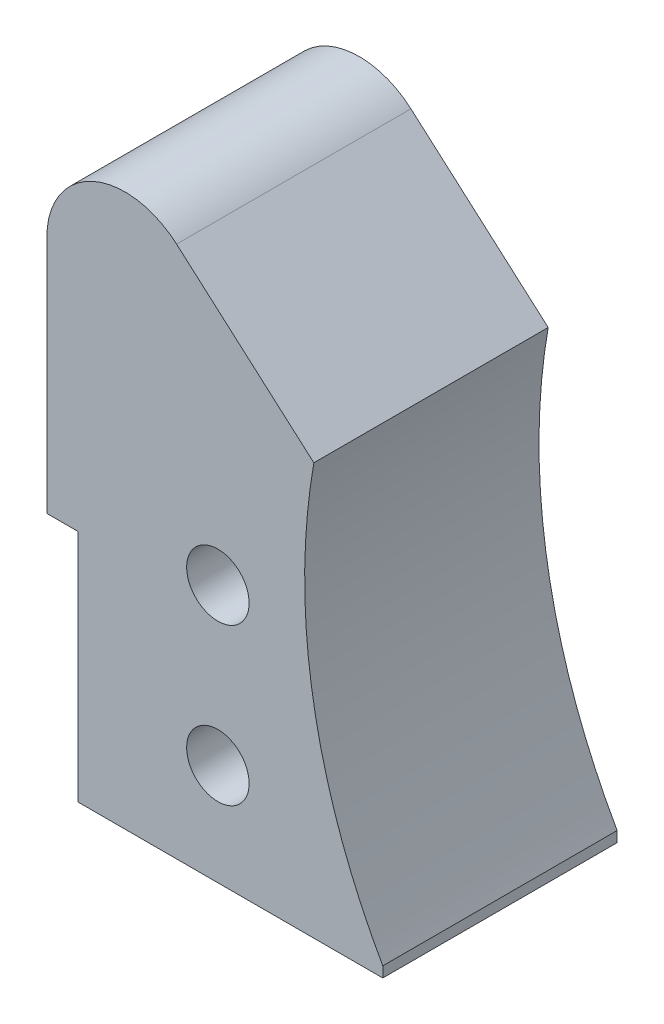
ISO-10303-21;
HEADER;
FILE_DESCRIPTION(('STEP AP214'),'2;1');
FILE_NAME('part.step','',(''),(''),'','','');
FILE_SCHEMA(('AUTOMOTIVE_DESIGN { 1 0 10303 214 1 1 1 1 }'));
ENDSEC;
DATA;
#1=APPLICATION_CONTEXT('core data for automotive mechanical design processes');
#2=APPLICATION_PROTOCOL_DEFINITION('international standard','automotive_design',2000,#1);
#3=PRODUCT_CONTEXT('',#1,'mechanical');
#4=PRODUCT('Part','Part','',(#3));
#5=PRODUCT_RELATED_PRODUCT_CATEGORY('part','',(#4));
#6=PRODUCT_DEFINITION_FORMATION('','',#4);
#7=PRODUCT_DEFINITION_CONTEXT('part definition',#1,'design');
#8=PRODUCT_DEFINITION('design','',#6,#7);
#9=PRODUCT_DEFINITION_SHAPE('','',#8);
#10=(LENGTH_UNIT() NAMED_UNIT(*) SI_UNIT(.MILLI.,.METRE.));
#11=(NAMED_UNIT(*) PLANE_ANGLE_UNIT() SI_UNIT($,.RADIAN.));
#12=(NAMED_UNIT(*) SI_UNIT($,.STERADIAN.) SOLID_ANGLE_UNIT());
#13=UNCERTAINTY_MEASURE_WITH_UNIT(LENGTH_MEASURE(1.E-05),#10,'distance_accuracy_value','');
#14=(GEOMETRIC_REPRESENTATION_CONTEXT(3) GLOBAL_UNCERTAINTY_ASSIGNED_CONTEXT((#13)) GLOBAL_UNIT_ASSIGNED_CONTEXT((#10,
#11,#12)) REPRESENTATION_CONTEXT('',''));
#15=CARTESIAN_POINT('',(0.,0.,0.));
#16=DIRECTION('',(0.,0.,1.));
#17=DIRECTION('',(1.,0.,0.));
#18=AXIS2_PLACEMENT_3D('',#15,#16,#17);
#19=CARTESIAN_POINT('',(-50.,10.6794442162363,8.));
#20=DIRECTION('',(0.,0.,1.));
#21=DIRECTION('',(1.,0.,0.));
#22=AXIS2_PLACEMENT_3D('',#19,#20,#21);
#23=CYLINDRICAL_SURFACE('',#22,5.);
#24=CARTESIAN_POINT('',(-50.,10.6794442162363,-78.));
#25=DIRECTION('',(0.,0.,1.));
#26=DIRECTION('',(-1.,0.,0.));
#27=AXIS2_PLACEMENT_3D('',#24,#25,#26);
#28=CIRCLE('',#27,5.);
#29=CARTESIAN_POINT('',(-46.6980552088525,14.4340627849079,-78.));
#30=VERTEX_POINT('',#29);
#31=CARTESIAN_POINT('',(-55.,10.6794442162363,-78.));
#32=VERTEX_POINT('',#31);
#33=EDGE_CURVE('E21',#30,#32,#28,.T.);
#34=ORIENTED_EDGE('',*,*,#33,.F.);
#35=DIRECTION('',(0.,0.,1.));
#36=VECTOR('',#35,1.);
#37=CARTESIAN_POINT('',(-46.6980552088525,14.4340627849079,-78.));
#38=LINE('',#37,#36);
#39=CARTESIAN_POINT('',(-46.6980552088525,14.4340627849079,-93.));
#40=VERTEX_POINT('',#39);
#41=EDGE_CURVE('E11',#40,#30,#38,.T.);
#42=ORIENTED_EDGE('',*,*,#41,.F.);
#43=CARTESIAN_POINT('',(-50.,10.6794442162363,-93.));
#44=DIRECTION('',(0.,0.,-1.));
#45=DIRECTION('',(-1.,0.,0.));
#46=AXIS2_PLACEMENT_3D('',#43,#44,#45);
#47=CIRCLE('',#46,5.);
#48=CARTESIAN_POINT('',(-55.,10.6794442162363,-93.));
#49=VERTEX_POINT('',#48);
#50=EDGE_CURVE('E121',#49,#40,#47,.T.);
#51=ORIENTED_EDGE('',*,*,#50,.F.);
#52=DIRECTION('',(0.,0.,-1.));
#53=VECTOR('',#52,1.);
#54=CARTESIAN_POINT('',(-55.,10.6794442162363,-93.));
#55=LINE('',#54,#53);
#56=EDGE_CURVE('E109',#32,#49,#55,.T.);
#57=ORIENTED_EDGE('',*,*,#56,.F.);
#58=EDGE_LOOP('',(#34,#42,#51,#57));
#59=FACE_BOUND('',#58,.T.);
#60=ADVANCED_FACE('F17',(#59),#23,.T.);
#61=CARTESIAN_POINT('',(-13.2077791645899,-15.0184742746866,-78.));
#62=DIRECTION('',(0.660388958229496,0.750923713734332,0.));
#63=DIRECTION('',(0.,0.,-1.));
#64=AXIS2_PLACEMENT_3D('',#61,#62,#63);
#65=PLANE('',#64);
#66=DIRECTION('',(0.750923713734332,-0.660388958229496,0.));
#67=VECTOR('',#66,1.);
#68=CARTESIAN_POINT('',(-13.2077791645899,-15.0184742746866,-93.));
#69=LINE('',#68,#67);
#70=CARTESIAN_POINT('',(-37.9113433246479,6.7067165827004,-93.));
#71=VERTEX_POINT('',#70);
#72=EDGE_CURVE('E124',#40,#71,#69,.T.);
#73=ORIENTED_EDGE('',*,*,#72,.F.);
#74=ORIENTED_EDGE('',*,*,#41,.T.);
#75=DIRECTION('',(0.750923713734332,-0.660388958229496,0.));
#76=VECTOR('',#75,1.);
#77=CARTESIAN_POINT('',(-13.2077791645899,-15.0184742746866,-78.));
#78=LINE('',#77,#76);
#79=CARTESIAN_POINT('',(-37.9113433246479,6.7067165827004,-78.));
#80=VERTEX_POINT('',#79);
#81=EDGE_CURVE('E183',#30,#80,#78,.T.);
#82=ORIENTED_EDGE('',*,*,#81,.T.);
#83=DIRECTION('',(0.,0.,-1.));
#84=VECTOR('',#83,1.);
#85=CARTESIAN_POINT('',(-37.9113433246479,6.7067165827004,-78.));
#86=LINE('',#85,#84);
#87=EDGE_CURVE('E132',#80,#71,#86,.T.);
#88=ORIENTED_EDGE('',*,*,#87,.T.);
#89=EDGE_LOOP('',(#73,#74,#82,#88));
#90=FACE_BOUND('',#89,.T.);
#91=ADVANCED_FACE('F19',(#90),#65,.T.);
#92=CARTESIAN_POINT('',(-50.,5.35267143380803,-78.));
#93=DIRECTION('',(0.,0.,-1.));
#94=DIRECTION('',(0.,-1.,0.));
#95=AXIS2_PLACEMENT_3D('',#92,#93,#94);
#96=PLANE('',#95);
#97=CARTESIAN_POINT('',(-44.0547008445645,-3.14732856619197,-78.));
#98=DIRECTION('',(0.,0.,-1.));
#99=DIRECTION('',(-1.,0.,0.));
#100=AXIS2_PLACEMENT_3D('',#97,#98,#99);
#101=CIRCLE('',#100,2.);
#102=CARTESIAN_POINT('',(-46.0547008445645,-3.14732856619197,-78.));
#103=VERTEX_POINT('',#102);
#104=EDGE_CURVE('E208',#103,#103,#101,.T.);
#105=ORIENTED_EDGE('',*,*,#104,.T.);
#106=EDGE_LOOP('',(#105));
#107=FACE_BOUND('',#106,.T.);
#108=CARTESIAN_POINT('',(-44.0547008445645,-13.147328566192,-78.));
#109=DIRECTION('',(0.,0.,-1.));
#110=DIRECTION('',(-1.,0.,0.));
#111=AXIS2_PLACEMENT_3D('',#108,#109,#110);
#112=CIRCLE('',#111,2.);
#113=CARTESIAN_POINT('',(-46.0547008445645,-13.147328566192,-78.));
#114=VERTEX_POINT('',#113);
#115=EDGE_CURVE('E254',#114,#114,#112,.T.);
#116=ORIENTED_EDGE('',*,*,#115,.T.);
#117=EDGE_LOOP('',(#116));
#118=FACE_BOUND('',#117,.T.);
#119=ORIENTED_EDGE('',*,*,#81,.F.);
#120=ORIENTED_EDGE('',*,*,#33,.T.);
#121=DIRECTION('',(0.,1.,0.));
#122=VECTOR('',#121,1.);
#123=CARTESIAN_POINT('',(-55.,-4.64732856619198,-78.));
#124=LINE('',#123,#122);
#125=CARTESIAN_POINT('',(-55.,-4.64732856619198,-78.));
#126=VERTEX_POINT('',#125);
#127=EDGE_CURVE('E115',#126,#32,#124,.T.);
#128=ORIENTED_EDGE('',*,*,#127,.F.);
#129=DIRECTION('',(-1.,0.,0.));
#130=VECTOR('',#129,1.);
#131=CARTESIAN_POINT('',(-53.,-4.64732856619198,-78.));
#132=LINE('',#131,#130);
#133=CARTESIAN_POINT('',(-53.,-4.64732856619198,-78.));
#134=VERTEX_POINT('',#133);
#135=EDGE_CURVE('E49',#134,#126,#132,.T.);
#136=ORIENTED_EDGE('',*,*,#135,.F.);
#137=DIRECTION('',(0.,1.,0.));
#138=VECTOR('',#137,1.);
#139=CARTESIAN_POINT('',(-53.,-19.647328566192,-78.));
#140=LINE('',#139,#138);
#141=CARTESIAN_POINT('',(-53.,-19.647328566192,-78.));
#142=VERTEX_POINT('',#141);
#143=EDGE_CURVE('E168',#142,#134,#140,.T.);
#144=ORIENTED_EDGE('',*,*,#143,.F.);
#145=DIRECTION('',(-1.,0.,0.));
#146=VECTOR('',#145,1.);
#147=CARTESIAN_POINT('',(-33.5,-19.647328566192,-78.));
#148=LINE('',#147,#146);
#149=CARTESIAN_POINT('',(-33.5,-19.647328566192,-78.));
#150=VERTEX_POINT('',#149);
#151=EDGE_CURVE('E181',#150,#142,#148,.T.);
#152=ORIENTED_EDGE('',*,*,#151,.F.);
#153=DIRECTION('',(0.,-1.,0.));
#154=VECTOR('',#153,1.);
#155=CARTESIAN_POINT('',(-33.5,-18.9736659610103,-78.));
#156=LINE('',#155,#154);
#157=CARTESIAN_POINT('',(-33.5,-18.9736659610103,-78.));
#158=VERTEX_POINT('',#157);
#159=EDGE_CURVE('E160',#158,#150,#156,.T.);
#160=ORIENTED_EDGE('',*,*,#159,.F.);
#161=CARTESIAN_POINT('',(0.,0.,-78.));
#162=DIRECTION('',(0.,0.,1.));
#163=DIRECTION('',(-1.,0.,0.));
#164=AXIS2_PLACEMENT_3D('',#161,#162,#163);
#165=CIRCLE('',#164,38.5);
#166=EDGE_CURVE('E195',#80,#158,#165,.T.);
#167=ORIENTED_EDGE('',*,*,#166,.F.);
#168=EDGE_LOOP('',(#119,#120,#128,#136,#144,#152,#160,#167));
#169=FACE_BOUND('',#168,.T.);
#170=ADVANCED_FACE('F192',(#107,#118,#169),#96,.F.);
#171=CARTESIAN_POINT('',(-33.5,-19.647328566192,8.00000000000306));
#172=DIRECTION('',(0.,-1.,0.));
#173=DIRECTION('',(0.,0.,-1.));
#174=AXIS2_PLACEMENT_3D('',#171,#172,#173);
#175=PLANE('',#174);
#176=ORIENTED_EDGE('',*,*,#151,.T.);
#177=DIRECTION('',(0.,0.,-1.));
#178=VECTOR('',#177,1.);
#179=CARTESIAN_POINT('',(-53.,-19.647328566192,8.00000000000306));
#180=LINE('',#179,#178);
#181=CARTESIAN_POINT('',(-53.,-19.647328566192,-93.));
#182=VERTEX_POINT('',#181);
#183=EDGE_CURVE('E176',#142,#182,#180,.T.);
#184=ORIENTED_EDGE('',*,*,#183,.T.);
#185=DIRECTION('',(-1.,0.,0.));
#186=VECTOR('',#185,1.);
#187=CARTESIAN_POINT('',(0.,-19.647328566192,-93.));
#188=LINE('',#187,#186);
#189=CARTESIAN_POINT('',(-33.5,-19.647328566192,-93.));
#190=VERTEX_POINT('',#189);
#191=EDGE_CURVE('E151',#190,#182,#188,.T.);
#192=ORIENTED_EDGE('',*,*,#191,.F.);
#193=DIRECTION('',(0.,0.,-1.));
#194=VECTOR('',#193,1.);
#195=CARTESIAN_POINT('',(-33.5,-19.647328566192,8.00000000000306));
#196=LINE('',#195,#194);
#197=EDGE_CURVE('E164',#150,#190,#196,.T.);
#198=ORIENTED_EDGE('',*,*,#197,.F.);
#199=EDGE_LOOP('',(#176,#184,#192,#198));
#200=FACE_BOUND('',#199,.T.);
#201=ADVANCED_FACE('F222',(#200),#175,.T.);
#202=CARTESIAN_POINT('',(-53.,-4.64732856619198,8.00000000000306));
#203=DIRECTION('',(0.,-1.,0.));
#204=DIRECTION('',(0.,0.,-1.));
#205=AXIS2_PLACEMENT_3D('',#202,#203,#204);
#206=PLANE('',#205);
#207=ORIENTED_EDGE('',*,*,#135,.T.);
#208=DIRECTION('',(0.,0.,-1.));
#209=VECTOR('',#208,1.);
#210=CARTESIAN_POINT('',(-55.,-4.64732856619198,8.00000000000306));
#211=LINE('',#210,#209);
#212=CARTESIAN_POINT('',(-55.,-4.64732856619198,-93.));
#213=VERTEX_POINT('',#212);
#214=EDGE_CURVE('E118',#126,#213,#211,.T.);
#215=ORIENTED_EDGE('',*,*,#214,.T.);
#216=DIRECTION('',(-1.,0.,0.));
#217=VECTOR('',#216,1.);
#218=CARTESIAN_POINT('',(0.,-4.64732856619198,-93.));
#219=LINE('',#218,#217);
#220=CARTESIAN_POINT('',(-53.,-4.64732856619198,-93.));
#221=VERTEX_POINT('',#220);
#222=EDGE_CURVE('E130',#221,#213,#219,.T.);
#223=ORIENTED_EDGE('',*,*,#222,.F.);
#224=DIRECTION('',(0.,0.,-1.));
#225=VECTOR('',#224,1.);
#226=CARTESIAN_POINT('',(-53.,-4.64732856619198,8.00000000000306));
#227=LINE('',#226,#225);
#228=EDGE_CURVE('E173',#134,#221,#227,.T.);
#229=ORIENTED_EDGE('',*,*,#228,.F.);
#230=EDGE_LOOP('',(#207,#215,#223,#229));
#231=FACE_BOUND('',#230,.T.);
#232=ADVANCED_FACE('F228',(#231),#206,.T.);
#233=CARTESIAN_POINT('',(-53.,-19.647328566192,8.00000000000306));
#234=DIRECTION('',(-1.,0.,0.));
#235=DIRECTION('',(0.,0.,1.));
#236=AXIS2_PLACEMENT_3D('',#233,#234,#235);
#237=PLANE('',#236);
#238=ORIENTED_EDGE('',*,*,#143,.T.);
#239=ORIENTED_EDGE('',*,*,#228,.T.);
#240=DIRECTION('',(0.,1.,0.));
#241=VECTOR('',#240,1.);
#242=CARTESIAN_POINT('',(-53.,0.,-93.));
#243=LINE('',#242,#241);
#244=EDGE_CURVE('E155',#182,#221,#243,.T.);
#245=ORIENTED_EDGE('',*,*,#244,.F.);
#246=ORIENTED_EDGE('',*,*,#183,.F.);
#247=EDGE_LOOP('',(#238,#239,#245,#246));
#248=FACE_BOUND('',#247,.T.);
#249=ADVANCED_FACE('F226',(#248),#237,.T.);
#250=CARTESIAN_POINT('',(-55.,16.4083148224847,8.));
#251=DIRECTION('',(1.,0.,0.));
#252=DIRECTION('',(0.,1.,0.));
#253=AXIS2_PLACEMENT_3D('',#250,#251,#252);
#254=PLANE('',#253);
#255=ORIENTED_EDGE('',*,*,#127,.T.);
#256=ORIENTED_EDGE('',*,*,#56,.T.);
#257=DIRECTION('',(0.,1.,0.));
#258=VECTOR('',#257,1.);
#259=CARTESIAN_POINT('',(-55.,0.,-93.));
#260=LINE('',#259,#258);
#261=EDGE_CURVE('E114',#213,#49,#260,.T.);
#262=ORIENTED_EDGE('',*,*,#261,.F.);
#263=ORIENTED_EDGE('',*,*,#214,.F.);
#264=EDGE_LOOP('',(#255,#256,#262,#263));
#265=FACE_BOUND('',#264,.T.);
#266=ADVANCED_FACE('F111',(#265),#254,.F.);
#267=CARTESIAN_POINT('',(-33.5,0.,-108.));
#268=DIRECTION('',(1.,0.,0.));
#269=DIRECTION('',(0.,1.,0.));
#270=AXIS2_PLACEMENT_3D('',#267,#268,#269);
#271=PLANE('',#270);
#272=ORIENTED_EDGE('',*,*,#159,.T.);
#273=ORIENTED_EDGE('',*,*,#197,.T.);
#274=DIRECTION('',(0.,-1.,0.));
#275=VECTOR('',#274,1.);
#276=CARTESIAN_POINT('',(-33.5,0.,-93.));
#277=LINE('',#276,#275);
#278=CARTESIAN_POINT('',(-33.5,-18.9736659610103,-93.));
#279=VERTEX_POINT('',#278);
#280=EDGE_CURVE('E147',#279,#190,#277,.T.);
#281=ORIENTED_EDGE('',*,*,#280,.F.);
#282=DIRECTION('',(0.,0.,1.));
#283=VECTOR('',#282,1.);
#284=CARTESIAN_POINT('',(-33.5,-18.9736659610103,-108.));
#285=LINE('',#284,#283);
#286=EDGE_CURVE('E142',#279,#158,#285,.T.);
#287=ORIENTED_EDGE('',*,*,#286,.T.);
#288=EDGE_LOOP('',(#272,#273,#281,#287));
#289=FACE_BOUND('',#288,.T.);
#290=ADVANCED_FACE('F218',(#289),#271,.T.);
#291=CARTESIAN_POINT('',(0.,0.,-93.));
#292=DIRECTION('',(0.,0.,-1.));
#293=DIRECTION('',(0.,-1.,0.));
#294=AXIS2_PLACEMENT_3D('',#291,#292,#293);
#295=PLANE('',#294);
#296=CARTESIAN_POINT('',(-44.0547008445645,-3.14732856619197,-93.));
#297=DIRECTION('',(0.,0.,-1.));
#298=DIRECTION('',(-1.,0.,0.));
#299=AXIS2_PLACEMENT_3D('',#296,#297,#298);
#300=CIRCLE('',#299,2.);
#301=CARTESIAN_POINT('',(-46.0547008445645,-3.14732856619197,-93.));
#302=VERTEX_POINT('',#301);
#303=EDGE_CURVE('E200',#302,#302,#300,.T.);
#304=ORIENTED_EDGE('',*,*,#303,.F.);
#305=EDGE_LOOP('',(#304));
#306=FACE_BOUND('',#305,.T.);
#307=CARTESIAN_POINT('',(-44.0547008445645,-13.147328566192,-93.));
#308=DIRECTION('',(0.,0.,-1.));
#309=DIRECTION('',(-1.,0.,0.));
#310=AXIS2_PLACEMENT_3D('',#307,#308,#309);
#311=CIRCLE('',#310,2.);
#312=CARTESIAN_POINT('',(-46.0547008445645,-13.147328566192,-93.));
#313=VERTEX_POINT('',#312);
#314=EDGE_CURVE('E257',#313,#313,#311,.T.);
#315=ORIENTED_EDGE('',*,*,#314,.F.);
#316=EDGE_LOOP('',(#315));
#317=FACE_BOUND('',#316,.T.);
#318=ORIENTED_EDGE('',*,*,#261,.T.);
#319=ORIENTED_EDGE('',*,*,#50,.T.);
#320=ORIENTED_EDGE('',*,*,#72,.T.);
#321=CARTESIAN_POINT('',(0.,0.,-93.));
#322=DIRECTION('',(0.,0.,1.));
#323=DIRECTION('',(-1.,0.,0.));
#324=AXIS2_PLACEMENT_3D('',#321,#322,#323);
#325=CIRCLE('',#324,38.5);
#326=EDGE_CURVE('E139',#71,#279,#325,.T.);
#327=ORIENTED_EDGE('',*,*,#326,.T.);
#328=ORIENTED_EDGE('',*,*,#280,.T.);
#329=ORIENTED_EDGE('',*,*,#191,.T.);
#330=ORIENTED_EDGE('',*,*,#244,.T.);
#331=ORIENTED_EDGE('',*,*,#222,.T.);
#332=EDGE_LOOP('',(#318,#319,#320,#327,#328,#329,#330,#331));
#333=FACE_BOUND('',#332,.T.);
#334=ADVANCED_FACE('F127',(#306,#317,#333),#295,.T.);
#335=CARTESIAN_POINT('',(0.,0.,-108.));
#336=DIRECTION('',(0.,0.,1.));
#337=DIRECTION('',(1.,0.,0.));
#338=AXIS2_PLACEMENT_3D('',#335,#336,#337);
#339=CYLINDRICAL_SURFACE('',#338,38.5);
#340=ORIENTED_EDGE('',*,*,#166,.T.);
#341=ORIENTED_EDGE('',*,*,#286,.F.);
#342=ORIENTED_EDGE('',*,*,#326,.F.);
#343=ORIENTED_EDGE('',*,*,#87,.F.);
#344=EDGE_LOOP('',(#340,#341,#342,#343));
#345=FACE_BOUND('',#344,.T.);
#346=ADVANCED_FACE('F216',(#345),#339,.F.);
#347=CARTESIAN_POINT('',(-44.0547008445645,-3.14732856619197,-88.));
#348=DIRECTION('',(0.,0.,-1.));
#349=DIRECTION('',(-1.,0.,0.));
#350=AXIS2_PLACEMENT_3D('',#347,#348,#349);
#351=CYLINDRICAL_SURFACE('',#350,2.);
#352=ORIENTED_EDGE('',*,*,#303,.T.);
#353=EDGE_LOOP('',(#352));
#354=FACE_BOUND('',#353,.T.);
#355=ORIENTED_EDGE('',*,*,#104,.F.);
#356=EDGE_LOOP('',(#355));
#357=FACE_BOUND('',#356,.T.);
#358=ADVANCED_FACE('F364',(#354,#357),#351,.F.);
#359=CARTESIAN_POINT('',(-44.0547008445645,-13.147328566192,-88.));
#360=DIRECTION('',(0.,0.,-1.));
#361=DIRECTION('',(-1.,0.,0.));
#362=AXIS2_PLACEMENT_3D('',#359,#360,#361);
#363=CYLINDRICAL_SURFACE('',#362,2.);
#364=ORIENTED_EDGE('',*,*,#314,.T.);
#365=EDGE_LOOP('',(#364));
#366=FACE_BOUND('',#365,.T.);
#367=ORIENTED_EDGE('',*,*,#115,.F.);
#368=EDGE_LOOP('',(#367));
#369=FACE_BOUND('',#368,.T.);
#370=ADVANCED_FACE('F358',(#366,#369),#363,.F.);
#371=CLOSED_SHELL('',(#60,#91,#170,#201,#232,#249,#266,#290,#334,#346,#358,#370));
#372=MANIFOLD_SOLID_BREP('B1',#371);
#373=ADVANCED_BREP_SHAPE_REPRESENTATION('',(#18,#372),#14);
#374=SHAPE_DEFINITION_REPRESENTATION(#9,#373);
ENDSEC;
END-ISO-10303-21;
